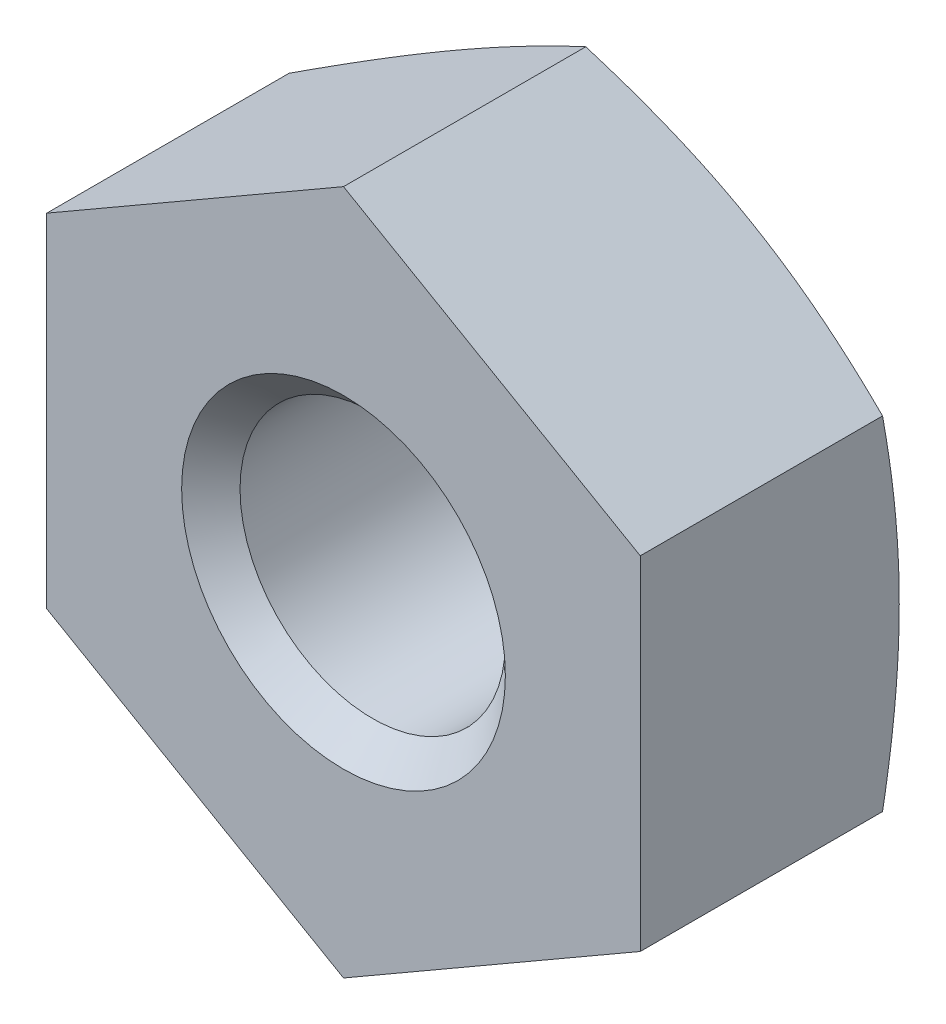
ISO-10303-21;
HEADER;
FILE_DESCRIPTION(('STEP AP214'),'2;1');
FILE_NAME('part.step','',(''),(''),'','','');
FILE_SCHEMA(('AUTOMOTIVE_DESIGN { 1 0 10303 214 1 1 1 1 }'));
ENDSEC;
DATA;
#1=APPLICATION_CONTEXT('core data for automotive mechanical design processes');
#2=APPLICATION_PROTOCOL_DEFINITION('international standard','automotive_design',2000,#1);
#3=PRODUCT_CONTEXT('',#1,'mechanical');
#4=PRODUCT('Part','Part','',(#3));
#5=PRODUCT_RELATED_PRODUCT_CATEGORY('part','',(#4));
#6=PRODUCT_DEFINITION_FORMATION('','',#4);
#7=PRODUCT_DEFINITION_CONTEXT('part definition',#1,'design');
#8=PRODUCT_DEFINITION('design','',#6,#7);
#9=PRODUCT_DEFINITION_SHAPE('','',#8);
#10=(LENGTH_UNIT() NAMED_UNIT(*) SI_UNIT(.MILLI.,.METRE.));
#11=(NAMED_UNIT(*) PLANE_ANGLE_UNIT() SI_UNIT($,.RADIAN.));
#12=(NAMED_UNIT(*) SI_UNIT($,.STERADIAN.) SOLID_ANGLE_UNIT());
#13=UNCERTAINTY_MEASURE_WITH_UNIT(LENGTH_MEASURE(1.E-05),#10,'distance_accuracy_value','');
#14=(GEOMETRIC_REPRESENTATION_CONTEXT(3) GLOBAL_UNCERTAINTY_ASSIGNED_CONTEXT((#13)) GLOBAL_UNIT_ASSIGNED_CONTEXT((#10,
#11,#12)) REPRESENTATION_CONTEXT('',''));
#15=CARTESIAN_POINT('',(0.,0.,0.));
#16=DIRECTION('',(0.,0.,1.));
#17=DIRECTION('',(1.,0.,0.));
#18=AXIS2_PLACEMENT_3D('',#15,#16,#17);
#19=CARTESIAN_POINT('',(0.,0.,0.155771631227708));
#20=DIRECTION('',(0.,0.,1.));
#21=DIRECTION('',(1.,0.,0.));
#22=AXIS2_PLACEMENT_3D('',#19,#20,#21);
#23=CONICAL_SURFACE('',#22,3.17797903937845,1.22173047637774);
#24=CARTESIAN_POINT('',(1.37500000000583,2.38156986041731,-1.29251920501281E-11));
#25=CARTESIAN_POINT('',(1.43272098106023,2.34824463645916,-4.39268432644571E-06));
#26=CARTESIAN_POINT('',(1.49043893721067,2.31492115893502,0.000882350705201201));
#27=CARTESIAN_POINT('',(1.60583141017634,2.24829928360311,0.00440051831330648));
#28=CARTESIAN_POINT('',(1.66350592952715,2.21500088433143,0.00703183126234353));
#29=CARTESIAN_POINT('',(1.83617397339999,2.11531094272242,0.0174715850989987));
#30=CARTESIAN_POINT('',(1.95105793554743,2.04898265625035,0.0278261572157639));
#31=CARTESIAN_POINT('',(2.18021806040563,1.91667699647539,0.0546479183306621));
#32=CARTESIAN_POINT('',(2.29449446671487,1.85069948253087,0.0711124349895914));
#33=CARTESIAN_POINT('',(2.52263797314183,1.71898076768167,0.109276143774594));
#34=CARTESIAN_POINT('',(2.63650372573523,1.65324034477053,0.130986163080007));
#35=CARTESIAN_POINT('',(2.74999991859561,1.58771328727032,0.154842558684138));
#36=B_SPLINE_CURVE_WITH_KNOTS('',3,(#24,#25,#26,#27,#28,#29,#30,#31,#32,#33,#34,#35),
.UNSPECIFIED.,.F.,.F.,(4,2,2,2,2,4),(0.,0.199938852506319,0.399864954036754,0.798866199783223,
1.19769313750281,1.59735042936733),.UNSPECIFIED.);
#37=CARTESIAN_POINT('',(1.37500000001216,2.38156986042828,4.10165090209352E-12));
#38=VERTEX_POINT('',#37);
#39=CARTESIAN_POINT('',(2.75,1.58771326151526,0.154842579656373));
#40=VERTEX_POINT('',#39);
#41=EDGE_CURVE('E20',#38,#40,#36,.T.);
#42=ORIENTED_EDGE('',*,*,#41,.T.);
#43=CARTESIAN_POINT('',(2.74999995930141,1.5877132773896,0.154842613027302));
#44=CARTESIAN_POINT('',(2.74999998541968,1.45665915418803,0.130986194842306));
#45=CARTESIAN_POINT('',(2.74999999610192,1.32517829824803,0.109276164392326));
#46=CARTESIAN_POINT('',(2.75000000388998,1.06174084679,0.0711124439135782));
#47=CARTESIAN_POINT('',(2.75000000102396,0.92978580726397,0.0546479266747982));
#48=CARTESIAN_POINT('',(2.74999999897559,0.665174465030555,0.0278261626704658));
#49=CARTESIAN_POINT('',(2.74999999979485,0.532517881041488,0.0174715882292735));
#50=CARTESIAN_POINT('',(2.75000000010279,0.333137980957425,0.00703183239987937));
#51=CARTESIAN_POINT('',(2.7500000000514,0.266541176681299,0.00440051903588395));
#52=CARTESIAN_POINT('',(2.7499999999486,0.133297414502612,0.000882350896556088));
#53=CARTESIAN_POINT('',(2.7499999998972,0.0666504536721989,-4.39260806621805E-06));
#54=CARTESIAN_POINT('',(2.75,-1.48706243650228E-12,-4.75322736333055E-12));
#55=B_SPLINE_CURVE_WITH_KNOTS('',3,(#43,#44,#45,#46,#47,#48,#49,#50,#51,#52,#53,#54),
.UNSPECIFIED.,.F.,.F.,(4,2,2,2,2,4),(0.,0.399657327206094,0.798484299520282,1.19748557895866,
1.3974116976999,1.59735056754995),.UNSPECIFIED.);
#56=CARTESIAN_POINT('',(2.75000000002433,0.,4.10183311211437E-12));
#57=VERTEX_POINT('',#56);
#58=EDGE_CURVE('E98',#40,#57,#55,.T.);
#59=ORIENTED_EDGE('',*,*,#58,.T.);
#60=CARTESIAN_POINT('',(0.,0.,1.29568935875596E-11));
#61=DIRECTION('',(0.,0.,1.));
#62=DIRECTION('',(1.,0.,0.));
#63=AXIS2_PLACEMENT_3D('',#60,#61,#62);
#64=CIRCLE('',#63,2.75000000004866);
#65=EDGE_CURVE('E100',#57,#38,#64,.T.);
#66=ORIENTED_EDGE('',*,*,#65,.T.);
#67=EDGE_LOOP('',(#42,#59,#66));
#68=FACE_BOUND('',#67,.T.);
#69=ADVANCED_FACE('F16',(#68),#23,.T.);
#70=CARTESIAN_POINT('',(0.,0.,0.155771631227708));
#71=DIRECTION('',(0.,0.,1.));
#72=DIRECTION('',(1.,0.,0.));
#73=AXIS2_PLACEMENT_3D('',#70,#71,#72);
#74=CONICAL_SURFACE('',#73,3.17797903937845,1.22173047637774);
#75=CARTESIAN_POINT('',(-5.24972382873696E-08,3.17542646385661,0.154842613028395));
#76=CARTESIAN_POINT('',(0.113496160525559,3.10989942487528,0.130986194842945));
#77=CARTESIAN_POINT('',(0.22736192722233,3.04415900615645,0.109276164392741));
#78=CARTESIAN_POINT('',(0.455505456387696,2.91244028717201,0.0711124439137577));
#79=CARTESIAN_POINT('',(0.569781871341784,2.84646276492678,0.054647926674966));
#80=CARTESIAN_POINT('',(0.79894201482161,2.71415709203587,0.0278261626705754));
#81=CARTESIAN_POINT('',(0.913825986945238,2.64782880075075,0.0174715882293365));
#82=CARTESIAN_POINT('',(1.0864940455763,2.54813885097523,0.00703183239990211));
#83=CARTESIAN_POINT('',(1.14416856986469,2.5148404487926,0.00440051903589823));
#84=CARTESIAN_POINT('',(1.25956105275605,2.44821856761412,0.000882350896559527));
#85=CARTESIAN_POINT('',(1.31727901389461,2.41489508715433,-4.39260806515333E-06));
#86=CARTESIAN_POINT('',(1.37500000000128,2.38156986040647,-4.75349668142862E-12));
#87=B_SPLINE_CURVE_WITH_KNOTS('',3,(#75,#76,#77,#78,#79,#80,#81,#82,#83,#84,#85,#86),
.UNSPECIFIED.,.F.,.F.,(4,2,2,2,2,4),(0.,0.399657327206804,0.798484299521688,1.19748557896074,
1.39741169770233,1.59735056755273),.UNSPECIFIED.);
#88=CARTESIAN_POINT('',(-1.83988536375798E-08,3.17542649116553,0.154842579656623));
#89=VERTEX_POINT('',#88);
#90=EDGE_CURVE('E94',#89,#38,#87,.T.);
#91=ORIENTED_EDGE('',*,*,#90,.T.);
#92=CARTESIAN_POINT('',(0.,0.,1.29568935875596E-11));
#93=DIRECTION('',(0.,0.,1.));
#94=DIRECTION('',(1.,0.,0.));
#95=AXIS2_PLACEMENT_3D('',#92,#93,#94);
#96=CIRCLE('',#95,2.75000000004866);
#97=CARTESIAN_POINT('',(-1.37500000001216,2.38156986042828,4.10162560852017E-12));
#98=VERTEX_POINT('',#97);
#99=EDGE_CURVE('E105',#38,#98,#96,.T.);
#100=ORIENTED_EDGE('',*,*,#99,.T.);
#101=CARTESIAN_POINT('',(-1.3750000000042,2.3815698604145,-1.06451466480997E-11));
#102=CARTESIAN_POINT('',(-1.31727901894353,2.41489508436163,-4.39268348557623E-06));
#103=CARTESIAN_POINT('',(-1.25956106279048,2.44821856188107,0.000882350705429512));
#104=CARTESIAN_POINT('',(-1.14416858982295,2.51484043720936,0.00440051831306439));
#105=CARTESIAN_POINT('',(-1.0864940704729,2.54813883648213,0.00703183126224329));
#106=CARTESIAN_POINT('',(-0.913826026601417,2.64782877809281,0.0174715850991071));
#107=CARTESIAN_POINT('',(-0.798942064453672,2.71415706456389,0.0278261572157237));
#108=CARTESIAN_POINT('',(-0.56978193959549,2.8464627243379,0.0546479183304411));
#109=CARTESIAN_POINT('',(-0.455505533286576,2.91244023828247,0.071112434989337));
#110=CARTESIAN_POINT('',(-0.227362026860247,3.04415895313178,0.109276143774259));
#111=CARTESIAN_POINT('',(-0.113496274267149,3.10989937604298,0.130986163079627));
#112=CARTESIAN_POINT('',(-8.14067742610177E-08,3.17542643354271,0.154842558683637));
#113=B_SPLINE_CURVE_WITH_KNOTS('',3,(#101,#102,#103,#104,#105,#106,#107,#108,#109,#110,#111,
#112),.UNSPECIFIED.,.F.,.F.,(4,2,2,2,2,4),(0.,0.199938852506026,0.399864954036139,
0.798866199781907,1.19769313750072,1.59735042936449),.UNSPECIFIED.);
#114=EDGE_CURVE('E113',#98,#89,#113,.T.);
#115=ORIENTED_EDGE('',*,*,#114,.T.);
#116=EDGE_LOOP('',(#91,#100,#115));
#117=FACE_BOUND('',#116,.T.);
#118=ADVANCED_FACE('F111',(#117),#74,.T.);
#119=CARTESIAN_POINT('',(0.,0.,0.155771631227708));
#120=DIRECTION('',(0.,0.,1.));
#121=DIRECTION('',(1.,0.,0.));
#122=AXIS2_PLACEMENT_3D('',#119,#120,#121);
#123=CONICAL_SURFACE('',#122,3.17797903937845,1.22173047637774);
#124=CARTESIAN_POINT('',(-1.37500000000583,-2.38156986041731,-1.29252694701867E-11));
#125=CARTESIAN_POINT('',(-1.43272098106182,-2.34824463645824,-4.39268432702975E-06));
#126=CARTESIAN_POINT('',(-1.49043893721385,-2.31492115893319,0.000882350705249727));
#127=CARTESIAN_POINT('',(-1.6058314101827,-2.24829928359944,0.00440051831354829));
#128=CARTESIAN_POINT('',(-1.66350592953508,-2.21500088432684,0.00703183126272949));
#129=CARTESIAN_POINT('',(-1.83617397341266,-2.11531094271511,0.017471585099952));
#130=CARTESIAN_POINT('',(-1.95105793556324,-2.04898265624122,0.0278261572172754));
#131=CARTESIAN_POINT('',(-2.18021806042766,-1.91667699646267,0.0546479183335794));
#132=CARTESIAN_POINT('',(-2.29449446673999,-1.85069948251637,0.0711124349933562));
#133=CARTESIAN_POINT('',(-2.5226379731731,-1.71898076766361,0.109276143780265));
#134=CARTESIAN_POINT('',(-2.63650372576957,-1.6532403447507,0.130986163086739));
#135=CARTESIAN_POINT('',(-2.74999991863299,-1.58771328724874,0.154842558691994));
#136=B_SPLINE_CURVE_WITH_KNOTS('',3,(#124,#125,#126,#127,#128,#129,#130,#131,#132,#133,#134,
#135),.UNSPECIFIED.,.F.,.F.,(4,2,2,2,2,4),(0.,0.199938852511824,0.399864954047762,
0.79886619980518,1.1976931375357,1.5973504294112),.UNSPECIFIED.);
#137=CARTESIAN_POINT('',(-1.37500000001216,-2.38156986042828,4.10163572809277E-12));
#138=VERTEX_POINT('',#137);
#139=CARTESIAN_POINT('',(-2.75,-1.58771326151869,0.154842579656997));
#140=VERTEX_POINT('',#139);
#141=EDGE_CURVE('E114',#138,#140,#136,.T.);
#142=ORIENTED_EDGE('',*,*,#141,.T.);
#143=CARTESIAN_POINT('',(-2.74999995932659,-1.58771327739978,0.154842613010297));
#144=CARTESIAN_POINT('',(-2.7499999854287,-1.45665915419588,0.130986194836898));
#145=CARTESIAN_POINT('',(-2.74999999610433,-1.32517829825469,0.109276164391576));
#146=CARTESIAN_POINT('',(-2.75000000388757,-1.06174084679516,0.0711124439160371));
#147=CARTESIAN_POINT('',(-2.75000000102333,-0.929785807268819,0.0546479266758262));
#148=CARTESIAN_POINT('',(-2.74999999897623,-0.665174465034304,0.0278261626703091));
#149=CARTESIAN_POINT('',(-2.74999999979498,-0.532517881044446,0.017471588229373));
#150=CARTESIAN_POINT('',(-2.75000000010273,-0.333137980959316,0.00703183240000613));
#151=CARTESIAN_POINT('',(-2.75000000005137,-0.266541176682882,0.00440051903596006));
#152=CARTESIAN_POINT('',(-2.74999999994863,-0.133297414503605,0.000882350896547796));
#153=CARTESIAN_POINT('',(-2.74999999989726,-0.0666504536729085,-4.39260810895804E-06));
#154=CARTESIAN_POINT('',(-2.75,1.07165013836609E-12,-4.75322187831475E-12));
#155=B_SPLINE_CURVE_WITH_KNOTS('',3,(#143,#144,#145,#146,#147,#148,#149,#150,#151,#152,#153,
#154),.UNSPECIFIED.,.F.,.F.,(4,2,2,2,2,4),(0.,0.399657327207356,0.798484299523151,
1.19748557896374,1.39741169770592,1.59735056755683),.UNSPECIFIED.);
#156=CARTESIAN_POINT('',(-2.75000000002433,0.,4.10183585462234E-12));
#157=VERTEX_POINT('',#156);
#158=EDGE_CURVE('E176',#140,#157,#155,.T.);
#159=ORIENTED_EDGE('',*,*,#158,.T.);
#160=CARTESIAN_POINT('',(0.,0.,1.29568935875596E-11));
#161=DIRECTION('',(0.,0.,1.));
#162=DIRECTION('',(1.,0.,0.));
#163=AXIS2_PLACEMENT_3D('',#160,#161,#162);
#164=CIRCLE('',#163,2.75000000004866);
#165=EDGE_CURVE('E122',#157,#138,#164,.T.);
#166=ORIENTED_EDGE('',*,*,#165,.T.);
#167=EDGE_LOOP('',(#142,#159,#166));
#168=FACE_BOUND('',#167,.T.);
#169=ADVANCED_FACE('F159',(#168),#123,.T.);
#170=CARTESIAN_POINT('',(0.,0.,0.155771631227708));
#171=DIRECTION('',(0.,0.,1.));
#172=DIRECTION('',(1.,0.,0.));
#173=AXIS2_PLACEMENT_3D('',#170,#171,#172);
#174=CONICAL_SURFACE('',#173,3.17797903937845,1.22173047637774);
#175=CARTESIAN_POINT('',(1.37500000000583,-2.38156986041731,-1.29251146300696E-11));
#176=CARTESIAN_POINT('',(1.31727901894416,-2.41489508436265,-4.39268432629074E-06));
#177=CARTESIAN_POINT('',(1.2595610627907,-2.44821856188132,0.000882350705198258));
#178=CARTESIAN_POINT('',(1.14416858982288,-2.51484043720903,0.00440051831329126));
#179=CARTESIAN_POINT('',(1.08649407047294,-2.54813883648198,0.00703183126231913));
#180=CARTESIAN_POINT('',(0.913826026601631,-2.64782877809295,0.0174715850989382));
#181=CARTESIAN_POINT('',(0.798942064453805,-2.71415706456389,0.0278261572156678));
#182=CARTESIAN_POINT('',(0.569781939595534,-2.8464627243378,0.0546479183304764));
#183=CARTESIAN_POINT('',(0.455505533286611,-2.91244023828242,0.0711124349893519));
#184=CARTESIAN_POINT('',(0.227362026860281,-3.04415895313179,0.109276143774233));
#185=CARTESIAN_POINT('',(0.11349627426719,-3.10989937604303,0.130986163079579));
#186=CARTESIAN_POINT('',(8.14067736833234E-08,-3.17542643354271,0.154842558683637));
#187=B_SPLINE_CURVE_WITH_KNOTS('',3,(#175,#176,#177,#178,#179,#180,#181,#182,#183,#184,#185,
#186),.UNSPECIFIED.,.F.,.F.,(4,2,2,2,2,4),(0.,0.199938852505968,0.399864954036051,
0.798866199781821,1.19769313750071,1.59735042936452),.UNSPECIFIED.);
#188=CARTESIAN_POINT('',(1.37500000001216,-2.38156986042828,4.10160838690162E-12));
#189=VERTEX_POINT('',#188);
#190=CARTESIAN_POINT('',(1.8398853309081E-08,-3.17542649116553,0.154842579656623));
#191=VERTEX_POINT('',#190);
#192=EDGE_CURVE('E169',#189,#191,#187,.T.);
#193=ORIENTED_EDGE('',*,*,#192,.T.);
#194=CARTESIAN_POINT('',(5.24972378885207E-08,-3.17542646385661,0.154842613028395));
#195=CARTESIAN_POINT('',(-0.11349616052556,-3.10989942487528,0.130986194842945));
#196=CARTESIAN_POINT('',(-0.22736192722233,-3.04415900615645,0.109276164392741));
#197=CARTESIAN_POINT('',(-0.455505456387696,-2.91244028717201,0.0711124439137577));
#198=CARTESIAN_POINT('',(-0.569781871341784,-2.84646276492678,0.0546479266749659));
#199=CARTESIAN_POINT('',(-0.79894201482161,-2.71415709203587,0.0278261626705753));
#200=CARTESIAN_POINT('',(-0.913825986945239,-2.64782880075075,0.0174715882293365));
#201=CARTESIAN_POINT('',(-1.0864940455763,-2.54813885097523,0.00703183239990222));
#202=CARTESIAN_POINT('',(-1.14416856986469,-2.5148404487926,0.00440051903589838));
#203=CARTESIAN_POINT('',(-1.25956105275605,-2.44821856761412,0.000882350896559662));
#204=CARTESIAN_POINT('',(-1.31727901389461,-2.41489508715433,-4.39260806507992E-06));
#205=CARTESIAN_POINT('',(-1.37500000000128,-2.38156986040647,-4.75359190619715E-12));
#206=B_SPLINE_CURVE_WITH_KNOTS('',3,(#194,#195,#196,#197,#198,#199,#200,#201,#202,#203,#204,
#205),.UNSPECIFIED.,.F.,.F.,(4,2,2,2,2,4),(0.,0.399657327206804,0.798484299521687,
1.19748557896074,1.39741169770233,1.59735056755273),.UNSPECIFIED.);
#207=EDGE_CURVE('E163',#191,#138,#206,.T.);
#208=ORIENTED_EDGE('',*,*,#207,.T.);
#209=CARTESIAN_POINT('',(0.,0.,1.29568935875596E-11));
#210=DIRECTION('',(0.,0.,1.));
#211=DIRECTION('',(1.,0.,0.));
#212=AXIS2_PLACEMENT_3D('',#209,#210,#211);
#213=CIRCLE('',#212,2.75000000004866);
#214=EDGE_CURVE('E125',#138,#189,#213,.T.);
#215=ORIENTED_EDGE('',*,*,#214,.T.);
#216=EDGE_LOOP('',(#193,#208,#215));
#217=FACE_BOUND('',#216,.T.);
#218=ADVANCED_FACE('F152',(#217),#174,.T.);
#219=CARTESIAN_POINT('',(0.,0.,0.155771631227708));
#220=DIRECTION('',(0.,0.,1.));
#221=DIRECTION('',(1.,0.,0.));
#222=AXIS2_PLACEMENT_3D('',#219,#220,#221);
#223=CONICAL_SURFACE('',#222,3.17797903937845,1.22173047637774);
#224=CARTESIAN_POINT('',(2.75000000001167,0.,-1.29240268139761E-11));
#225=CARTESIAN_POINT('',(2.7500000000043,-0.0666504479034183,-4.39268432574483E-06));
#226=CARTESIAN_POINT('',(2.75000000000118,-0.133297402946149,0.000882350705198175));
#227=CARTESIAN_POINT('',(2.74999999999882,-0.26654115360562,0.00440051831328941));
#228=CARTESIAN_POINT('',(2.74999999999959,-0.333137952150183,0.00703183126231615));
#229=CARTESIAN_POINT('',(2.75000000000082,-0.532517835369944,0.0174715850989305));
#230=CARTESIAN_POINT('',(2.75000000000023,-0.665174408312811,0.0278261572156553));
#231=CARTESIAN_POINT('',(2.74999999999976,-0.929785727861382,0.0546479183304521));
#232=CARTESIAN_POINT('',(2.74999999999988,-1.06174075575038,0.0711124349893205));
#233=CARTESIAN_POINT('',(2.75000000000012,-1.32517818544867,0.109276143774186));
#234=CARTESIAN_POINT('',(2.75000000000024,-1.45665903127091,0.130986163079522));
#235=CARTESIAN_POINT('',(2.75,-1.58771314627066,0.154842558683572));
#236=B_SPLINE_CURVE_WITH_KNOTS('',3,(#224,#225,#226,#227,#228,#229,#230,#231,#232,#233,#234,
#235),.UNSPECIFIED.,.F.,.F.,(4,2,2,2,2,4),(0.,0.199938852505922,0.39986495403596,
0.798866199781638,1.19769313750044,1.59735042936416),.UNSPECIFIED.);
#237=CARTESIAN_POINT('',(2.75000001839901,-1.5877132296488,0.154842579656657));
#238=VERTEX_POINT('',#237);
#239=EDGE_CURVE('E137',#57,#238,#236,.T.);
#240=ORIENTED_EDGE('',*,*,#239,.T.);
#241=CARTESIAN_POINT('',(2.75000001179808,-1.58771318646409,0.154842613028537));
#242=CARTESIAN_POINT('',(2.63650382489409,-1.65324027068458,0.130986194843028));
#243=CARTESIAN_POINT('',(2.52263806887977,-1.71898070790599,0.109276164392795));
#244=CARTESIAN_POINT('',(2.29449454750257,-1.85069944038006,0.0711124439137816));
#245=CARTESIAN_POINT('',(2.18021812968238,-1.91667695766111,0.054647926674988));
#246=CARTESIAN_POINT('',(1.95105798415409,-2.0489826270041,0.0278261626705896));
#247=CARTESIAN_POINT('',(1.83617401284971,-2.11531091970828,0.0174715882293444));
#248=CARTESIAN_POINT('',(1.66350595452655,-2.21500087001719,0.00703183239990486));
#249=CARTESIAN_POINT('',(1.60583143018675,-2.24829927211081,0.00440051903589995));
#250=CARTESIAN_POINT('',(1.49043894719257,-2.31492115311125,0.00088235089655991));
#251=CARTESIAN_POINT('',(1.43272098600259,-2.34824463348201,-4.39260806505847E-06));
#252=CARTESIAN_POINT('',(1.37499999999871,-2.38156986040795,-4.75363915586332E-12));
#253=B_SPLINE_CURVE_WITH_KNOTS('',3,(#241,#242,#243,#244,#245,#246,#247,#248,#249,#250,#251,
#252),.UNSPECIFIED.,.F.,.F.,(4,2,2,2,2,4),(0.,0.3996573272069,0.798484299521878,
1.19748557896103,1.39741169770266,1.59735056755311),.UNSPECIFIED.);
#254=EDGE_CURVE('E106',#238,#189,#253,.T.);
#255=ORIENTED_EDGE('',*,*,#254,.T.);
#256=CARTESIAN_POINT('',(0.,0.,1.29568935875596E-11));
#257=DIRECTION('',(0.,0.,1.));
#258=DIRECTION('',(1.,0.,0.));
#259=AXIS2_PLACEMENT_3D('',#256,#257,#258);
#260=CIRCLE('',#259,2.75000000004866);
#261=EDGE_CURVE('E381',#189,#57,#260,.T.);
#262=ORIENTED_EDGE('',*,*,#261,.T.);
#263=EDGE_LOOP('',(#240,#255,#262));
#264=FACE_BOUND('',#263,.T.);
#265=ADVANCED_FACE('F147',(#264),#223,.T.);
#266=CARTESIAN_POINT('',(0.,0.,0.));
#267=DIRECTION('',(0.,0.,1.));
#268=DIRECTION('',(1.,0.,0.));
#269=AXIS2_PLACEMENT_3D('',#266,#267,#268);
#270=PLANE('',#269);
#271=CARTESIAN_POINT('',(0.,0.,5.6843418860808E-11));
#272=DIRECTION('',(0.,0.,-1.));
#273=DIRECTION('',(-1.,0.,0.));
#274=AXIS2_PLACEMENT_3D('',#271,#272,#273);
#275=CIRCLE('',#274,1.49999999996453);
#276=CARTESIAN_POINT('',(-1.49999999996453,0.,5.6843418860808E-11));
#277=VERTEX_POINT('',#276);
#278=EDGE_CURVE('E382',#277,#277,#275,.F.);
#279=ORIENTED_EDGE('',*,*,#278,.T.);
#280=EDGE_LOOP('',(#279));
#281=FACE_BOUND('',#280,.T.);
#282=ORIENTED_EDGE('',*,*,#214,.F.);
#283=ORIENTED_EDGE('',*,*,#165,.F.);
#284=CARTESIAN_POINT('',(0.,0.,1.29568935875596E-11));
#285=DIRECTION('',(0.,0.,1.));
#286=DIRECTION('',(1.,0.,0.));
#287=AXIS2_PLACEMENT_3D('',#284,#285,#286);
#288=CIRCLE('',#287,2.75000000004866);
#289=EDGE_CURVE('E120',#98,#157,#288,.T.);
#290=ORIENTED_EDGE('',*,*,#289,.F.);
#291=ORIENTED_EDGE('',*,*,#99,.F.);
#292=ORIENTED_EDGE('',*,*,#65,.F.);
#293=ORIENTED_EDGE('',*,*,#261,.F.);
#294=EDGE_LOOP('',(#282,#283,#290,#291,#292,#293));
#295=FACE_BOUND('',#294,.T.);
#296=ADVANCED_FACE('F117',(#281,#295),#270,.F.);
#297=CARTESIAN_POINT('',(0.,0.,1.13686837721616E-10));
#298=DIRECTION('',(0.,0.,-1.));
#299=DIRECTION('',(-1.,0.,0.));
#300=AXIS2_PLACEMENT_3D('',#297,#298,#299);
#301=CONICAL_SURFACE('',#300,1.49999999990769,0.785398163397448);
#302=CARTESIAN_POINT('',(0.,0.,0.2705));
#303=DIRECTION('',(0.,0.,1.));
#304=DIRECTION('',(1.,0.,0.));
#305=AXIS2_PLACEMENT_3D('',#302,#303,#304);
#306=CIRCLE('',#305,1.2295);
#307=CARTESIAN_POINT('',(1.2295,0.,0.2705));
#308=VERTEX_POINT('',#307);
#309=EDGE_CURVE('E386',#308,#308,#306,.T.);
#310=ORIENTED_EDGE('',*,*,#309,.T.);
#311=EDGE_LOOP('',(#310));
#312=FACE_BOUND('',#311,.T.);
#313=ORIENTED_EDGE('',*,*,#278,.F.);
#314=EDGE_LOOP('',(#313));
#315=FACE_BOUND('',#314,.T.);
#316=ADVANCED_FACE('F218',(#312,#315),#301,.F.);
#317=CARTESIAN_POINT('',(0.,0.,0.155771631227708));
#318=DIRECTION('',(0.,0.,1.));
#319=DIRECTION('',(1.,0.,0.));
#320=AXIS2_PLACEMENT_3D('',#317,#318,#319);
#321=CONICAL_SURFACE('',#320,3.17797903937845,1.22173047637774);
#322=CARTESIAN_POINT('',(-2.75000000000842,0.,-1.06439431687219E-11));
#323=CARTESIAN_POINT('',(-2.7500000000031,0.06665045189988,-4.39268452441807E-06));
#324=CARTESIAN_POINT('',(-2.75000000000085,0.133297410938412,0.000882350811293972));
#325=CARTESIAN_POINT('',(-2.74999999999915,0.266541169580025,0.00440051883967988));
#326=CARTESIAN_POINT('',(-2.7499999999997,0.333137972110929,0.00703183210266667));
#327=CARTESIAN_POINT('',(-2.75000000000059,0.532517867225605,0.0174715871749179));
#328=CARTESIAN_POINT('',(-2.75000000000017,0.665174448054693,0.02782616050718));
#329=CARTESIAN_POINT('',(-2.74999999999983,0.92978578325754,0.0546479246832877));
#330=CARTESIAN_POINT('',(-2.74999999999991,1.06174081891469,0.0711124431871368));
#331=CARTESIAN_POINT('',(-2.75000000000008,1.32517826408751,0.109276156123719));
#332=CARTESIAN_POINT('',(-2.75000000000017,1.45665911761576,0.130986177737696));
#333=CARTESIAN_POINT('',(-2.75,1.58771324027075,0.154842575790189));
#334=B_SPLINE_CURVE_WITH_KNOTS('',3,(#322,#323,#324,#325,#326,#327,#328,#329,#330,#331,#332,
#333),.UNSPECIFIED.,.F.,.F.,(4,2,2,2,2,4),(0.,0.199938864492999,0.399864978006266,
0.798866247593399,1.1976932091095,1.5973505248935),.UNSPECIFIED.);
#335=CARTESIAN_POINT('',(-2.74999999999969,1.58771324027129,0.154842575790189));
#336=VERTEX_POINT('',#335);
#337=EDGE_CURVE('E199',#157,#336,#334,.T.);
#338=ORIENTED_EDGE('',*,*,#337,.T.);
#339=CARTESIAN_POINT('',(-2.74999999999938,1.58771324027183,0.154842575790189));
#340=CARTESIAN_POINT('',(-2.63650380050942,1.65324030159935,0.130986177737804));
#341=CARTESIAN_POINT('',(-2.52263804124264,1.71898072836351,0.109276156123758));
#342=CARTESIAN_POINT('',(-2.29449452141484,1.85069945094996,0.0711124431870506));
#343=CARTESIAN_POINT('',(-2.18021810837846,1.91667696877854,0.0546479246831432));
#344=CARTESIAN_POINT('',(-1.95105796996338,2.04898263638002,0.0278261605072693));
#345=CARTESIAN_POINT('',(-1.83617400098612,2.11531092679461,0.017471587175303));
#346=CARTESIAN_POINT('',(-1.66350594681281,2.21500087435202,0.00703183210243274));
#347=CARTESIAN_POINT('',(-1.60583142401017,2.24829927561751,0.00440051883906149));
#348=CARTESIAN_POINT('',(-1.49043894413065,2.3149211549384,0.000882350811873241));
#349=CARTESIAN_POINT('',(-1.4327209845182,2.34824463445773,-4.39268236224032E-06));
#350=CARTESIAN_POINT('',(-1.37499999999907,2.38156986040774,-4.75368783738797E-12));
#351=B_SPLINE_CURVE_WITH_KNOTS('',3,(#339,#340,#341,#342,#343,#344,#345,#346,#347,#348,#349,
#350),.UNSPECIFIED.,.F.,.F.,(4,2,2,2,2,4),(0.,0.399657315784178,0.798484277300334,
1.19748554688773,1.39741166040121,1.59735052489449),.UNSPECIFIED.);
#352=EDGE_CURVE('E207',#336,#98,#351,.T.);
#353=ORIENTED_EDGE('',*,*,#352,.T.);
#354=ORIENTED_EDGE('',*,*,#289,.T.);
#355=EDGE_LOOP('',(#338,#353,#354));
#356=FACE_BOUND('',#355,.T.);
#357=ADVANCED_FACE('F214',(#356),#321,.T.);
#358=CARTESIAN_POINT('',(0.,0.,0.));
#359=DIRECTION('',(0.,0.,1.));
#360=DIRECTION('',(1.,0.,0.));
#361=AXIS2_PLACEMENT_3D('',#358,#359,#360);
#362=CYLINDRICAL_SURFACE('',#361,1.2295);
#363=CARTESIAN_POINT('',(0.,0.,2.12950000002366));
#364=DIRECTION('',(0.,0.,1.));
#365=DIRECTION('',(1.,0.,0.));
#366=AXIS2_PLACEMENT_3D('',#363,#364,#365);
#367=CIRCLE('',#366,1.2295000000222);
#368=CARTESIAN_POINT('',(1.2295000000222,0.,2.12950000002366));
#369=VERTEX_POINT('',#368);
#370=EDGE_CURVE('E410',#369,#369,#367,.T.);
#371=ORIENTED_EDGE('',*,*,#370,.T.);
#372=EDGE_LOOP('',(#371));
#373=FACE_BOUND('',#372,.T.);
#374=ORIENTED_EDGE('',*,*,#309,.F.);
#375=EDGE_LOOP('',(#374));
#376=FACE_BOUND('',#375,.T.);
#377=ADVANCED_FACE('F217',(#373,#376),#362,.F.);
#378=CARTESIAN_POINT('',(0.,3.17542648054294,2.4));
#379=DIRECTION('',(0.5,-0.866025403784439,0.));
#380=DIRECTION('',(0.866025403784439,0.5,0.));
#381=AXIS2_PLACEMENT_3D('',#378,#379,#380);
#382=PLANE('',#381);
#383=ORIENTED_EDGE('',*,*,#114,.F.);
#384=ORIENTED_EDGE('',*,*,#352,.F.);
#385=DIRECTION('',(0.,0.,-1.));
#386=VECTOR('',#385,1.);
#387=CARTESIAN_POINT('',(-2.75,1.58771324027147,2.4));
#388=LINE('',#387,#386);
#389=CARTESIAN_POINT('',(-2.75,1.58771324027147,2.4));
#390=VERTEX_POINT('',#389);
#391=EDGE_CURVE('E206',#336,#390,#388,.F.);
#392=ORIENTED_EDGE('',*,*,#391,.T.);
#393=DIRECTION('',(-0.866025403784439,-0.5,0.));
#394=VECTOR('',#393,1.);
#395=CARTESIAN_POINT('',(0.,3.17542648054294,2.4));
#396=LINE('',#395,#394);
#397=CARTESIAN_POINT('',(0.,3.17542648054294,2.4));
#398=VERTEX_POINT('',#397);
#399=EDGE_CURVE('E406',#398,#390,#396,.T.);
#400=ORIENTED_EDGE('',*,*,#399,.F.);
#401=DIRECTION('',(0.,0.,1.));
#402=VECTOR('',#401,1.);
#403=CARTESIAN_POINT('',(0.,3.17542648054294,2.4));
#404=LINE('',#403,#402);
#405=EDGE_CURVE('E434',#398,#89,#404,.F.);
#406=ORIENTED_EDGE('',*,*,#405,.T.);
#407=EDGE_LOOP('',(#383,#384,#392,#400,#406));
#408=FACE_BOUND('',#407,.T.);
#409=ADVANCED_FACE('F192',(#408),#382,.F.);
#410=CARTESIAN_POINT('',(-2.75,1.58771324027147,2.4));
#411=DIRECTION('',(1.,0.,0.));
#412=DIRECTION('',(0.,0.,-1.));
#413=AXIS2_PLACEMENT_3D('',#410,#411,#412);
#414=PLANE('',#413);
#415=ORIENTED_EDGE('',*,*,#337,.F.);
#416=ORIENTED_EDGE('',*,*,#158,.F.);
#417=DIRECTION('',(0.,0.,1.));
#418=VECTOR('',#417,1.);
#419=CARTESIAN_POINT('',(-2.75,-1.58771324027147,2.4));
#420=LINE('',#419,#418);
#421=CARTESIAN_POINT('',(-2.75,-1.58771324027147,2.4));
#422=VERTEX_POINT('',#421);
#423=EDGE_CURVE('E428',#140,#422,#420,.T.);
#424=ORIENTED_EDGE('',*,*,#423,.T.);
#425=DIRECTION('',(0.,1.,0.));
#426=VECTOR('',#425,1.);
#427=CARTESIAN_POINT('',(-2.75,0.,2.4));
#428=LINE('',#427,#426);
#429=EDGE_CURVE('E409',#390,#422,#428,.F.);
#430=ORIENTED_EDGE('',*,*,#429,.F.);
#431=ORIENTED_EDGE('',*,*,#391,.F.);
#432=EDGE_LOOP('',(#415,#416,#424,#430,#431));
#433=FACE_BOUND('',#432,.T.);
#434=ADVANCED_FACE('F187',(#433),#414,.F.);
#435=CARTESIAN_POINT('',(-2.75,-1.58771324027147,2.4));
#436=DIRECTION('',(0.5,0.866025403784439,0.));
#437=DIRECTION('',(-0.866025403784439,0.5,0.));
#438=AXIS2_PLACEMENT_3D('',#435,#436,#437);
#439=PLANE('',#438);
#440=ORIENTED_EDGE('',*,*,#141,.F.);
#441=ORIENTED_EDGE('',*,*,#207,.F.);
#442=DIRECTION('',(0.,0.,1.));
#443=VECTOR('',#442,1.);
#444=CARTESIAN_POINT('',(0.,-3.17542648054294,2.4));
#445=LINE('',#444,#443);
#446=CARTESIAN_POINT('',(0.,-3.17542648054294,2.4));
#447=VERTEX_POINT('',#446);
#448=EDGE_CURVE('E430',#191,#447,#445,.T.);
#449=ORIENTED_EDGE('',*,*,#448,.T.);
#450=DIRECTION('',(0.866025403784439,-0.5,0.));
#451=VECTOR('',#450,1.);
#452=CARTESIAN_POINT('',(-2.75,-1.58771324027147,2.4));
#453=LINE('',#452,#451);
#454=EDGE_CURVE('E415',#422,#447,#453,.T.);
#455=ORIENTED_EDGE('',*,*,#454,.F.);
#456=ORIENTED_EDGE('',*,*,#423,.F.);
#457=EDGE_LOOP('',(#440,#441,#449,#455,#456));
#458=FACE_BOUND('',#457,.T.);
#459=ADVANCED_FACE('F191',(#458),#439,.F.);
#460=CARTESIAN_POINT('',(0.,-3.17542648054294,2.4));
#461=DIRECTION('',(-0.5,0.866025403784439,0.));
#462=DIRECTION('',(-0.866025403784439,-0.5,0.));
#463=AXIS2_PLACEMENT_3D('',#460,#461,#462);
#464=PLANE('',#463);
#465=ORIENTED_EDGE('',*,*,#192,.F.);
#466=ORIENTED_EDGE('',*,*,#254,.F.);
#467=DIRECTION('',(0.,0.,1.));
#468=VECTOR('',#467,1.);
#469=CARTESIAN_POINT('',(2.75,-1.58771324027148,2.4));
#470=LINE('',#469,#468);
#471=CARTESIAN_POINT('',(2.75,-1.58771324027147,2.4));
#472=VERTEX_POINT('',#471);
#473=EDGE_CURVE('E377',#238,#472,#470,.T.);
#474=ORIENTED_EDGE('',*,*,#473,.T.);
#475=DIRECTION('',(0.866025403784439,0.5,0.));
#476=VECTOR('',#475,1.);
#477=CARTESIAN_POINT('',(0.,-3.17542648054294,2.4));
#478=LINE('',#477,#476);
#479=EDGE_CURVE('E403',#447,#472,#478,.T.);
#480=ORIENTED_EDGE('',*,*,#479,.F.);
#481=ORIENTED_EDGE('',*,*,#448,.F.);
#482=EDGE_LOOP('',(#465,#466,#474,#480,#481));
#483=FACE_BOUND('',#482,.T.);
#484=ADVANCED_FACE('F144',(#483),#464,.F.);
#485=CARTESIAN_POINT('',(2.75,-1.58771324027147,2.4));
#486=DIRECTION('',(-1.,0.,0.));
#487=DIRECTION('',(0.,0.,1.));
#488=AXIS2_PLACEMENT_3D('',#485,#486,#487);
#489=PLANE('',#488);
#490=ORIENTED_EDGE('',*,*,#239,.F.);
#491=ORIENTED_EDGE('',*,*,#58,.F.);
#492=DIRECTION('',(0.,0.,1.));
#493=VECTOR('',#492,1.);
#494=CARTESIAN_POINT('',(2.75,1.58771324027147,2.4));
#495=LINE('',#494,#493);
#496=CARTESIAN_POINT('',(2.75,1.58771324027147,2.4));
#497=VERTEX_POINT('',#496);
#498=EDGE_CURVE('E40',#40,#497,#495,.T.);
#499=ORIENTED_EDGE('',*,*,#498,.T.);
#500=DIRECTION('',(0.,1.,0.));
#501=VECTOR('',#500,1.);
#502=CARTESIAN_POINT('',(2.75,0.,2.4));
#503=LINE('',#502,#501);
#504=EDGE_CURVE('E398',#472,#497,#503,.T.);
#505=ORIENTED_EDGE('',*,*,#504,.F.);
#506=ORIENTED_EDGE('',*,*,#473,.F.);
#507=EDGE_LOOP('',(#490,#491,#499,#505,#506));
#508=FACE_BOUND('',#507,.T.);
#509=ADVANCED_FACE('F245',(#508),#489,.F.);
#510=CARTESIAN_POINT('',(2.75,1.58771324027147,2.4));
#511=DIRECTION('',(-0.5,-0.866025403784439,0.));
#512=DIRECTION('',(0.866025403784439,-0.5,0.));
#513=AXIS2_PLACEMENT_3D('',#510,#511,#512);
#514=PLANE('',#513);
#515=ORIENTED_EDGE('',*,*,#41,.F.);
#516=ORIENTED_EDGE('',*,*,#90,.F.);
#517=ORIENTED_EDGE('',*,*,#405,.F.);
#518=DIRECTION('',(-0.866025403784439,0.5,0.));
#519=VECTOR('',#518,1.);
#520=CARTESIAN_POINT('',(2.75,1.58771324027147,2.4));
#521=LINE('',#520,#519);
#522=EDGE_CURVE('E31',#497,#398,#521,.T.);
#523=ORIENTED_EDGE('',*,*,#522,.F.);
#524=ORIENTED_EDGE('',*,*,#498,.F.);
#525=EDGE_LOOP('',(#515,#516,#517,#523,#524));
#526=FACE_BOUND('',#525,.T.);
#527=ADVANCED_FACE('F91',(#526),#514,.F.);
#528=CARTESIAN_POINT('',(0.,0.,2.39999999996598));
#529=DIRECTION('',(0.,0.,1.));
#530=DIRECTION('',(1.,0.,0.));
#531=AXIS2_PLACEMENT_3D('',#528,#529,#530);
#532=CONICAL_SURFACE('',#531,1.49999999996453,0.785398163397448);
#533=CARTESIAN_POINT('',(0.,0.,2.40000000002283));
#534=DIRECTION('',(0.,0.,1.));
#535=DIRECTION('',(1.,0.,0.));
#536=AXIS2_PLACEMENT_3D('',#533,#534,#535);
#537=CIRCLE('',#536,1.50000000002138);
#538=CARTESIAN_POINT('',(1.50000000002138,0.,2.40000000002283));
#539=VERTEX_POINT('',#538);
#540=EDGE_CURVE('E11',#539,#539,#537,.F.);
#541=ORIENTED_EDGE('',*,*,#540,.F.);
#542=EDGE_LOOP('',(#541));
#543=FACE_BOUND('',#542,.T.);
#544=ORIENTED_EDGE('',*,*,#370,.F.);
#545=EDGE_LOOP('',(#544));
#546=FACE_BOUND('',#545,.T.);
#547=ADVANCED_FACE('F233',(#543,#546),#532,.F.);
#548=CARTESIAN_POINT('',(0.,0.,2.4));
#549=DIRECTION('',(0.,0.,1.));
#550=DIRECTION('',(1.,0.,0.));
#551=AXIS2_PLACEMENT_3D('',#548,#549,#550);
#552=PLANE('',#551);
#553=ORIENTED_EDGE('',*,*,#540,.T.);
#554=EDGE_LOOP('',(#553));
#555=FACE_BOUND('',#554,.T.);
#556=ORIENTED_EDGE('',*,*,#504,.T.);
#557=ORIENTED_EDGE('',*,*,#522,.T.);
#558=ORIENTED_EDGE('',*,*,#399,.T.);
#559=ORIENTED_EDGE('',*,*,#429,.T.);
#560=ORIENTED_EDGE('',*,*,#454,.T.);
#561=ORIENTED_EDGE('',*,*,#479,.T.);
#562=EDGE_LOOP('',(#556,#557,#558,#559,#560,#561));
#563=FACE_BOUND('',#562,.T.);
#564=ADVANCED_FACE('F231',(#555,#563),#552,.T.);
#565=CLOSED_SHELL('',(#69,#118,#169,#218,#265,#296,#316,#357,#377,#409,#434,#459,#484,#509,#527,
#547,#564));
#566=MANIFOLD_SOLID_BREP('B1',#565);
#567=ADVANCED_BREP_SHAPE_REPRESENTATION('',(#18,#566),#14);
#568=SHAPE_DEFINITION_REPRESENTATION(#9,#567);
ENDSEC;
END-ISO-10303-21;
